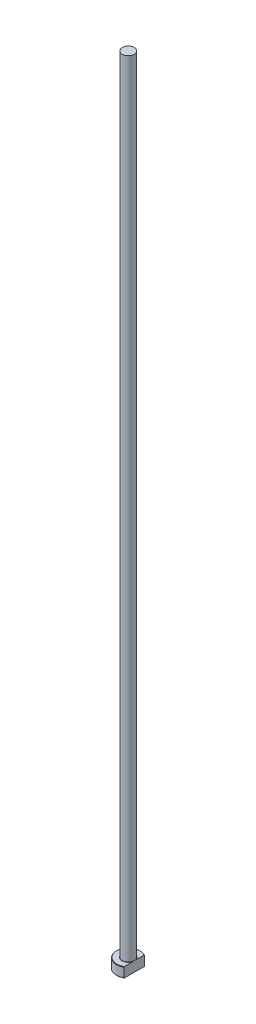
from build123d import *
from build123d.topology import SkipClean

# Parameters (mm, degrees)
CHAMFER1_SIZE = 0.2
FILLET1_R     = 0.2
KEY_DEPTH     = 401.089989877


with BuildPart() as part:
    # Sketch1 → Revolve1 (revolve)
    with BuildSketch(Plane.XY, mode=Mode.PRIVATE) as revolve1_sk:
        Polygon((0, 0), (-6, 0), (-6, 5), (-3, 5), (-3, 400), (0, 400), align=None)
    revolve(revolve1_sk.sketch.rotate(Axis((0, 259.958771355, 0), (0, -1, 0)), 270), axis=Axis((0, 259.958771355, 0), (0, -1, 0)))

    # Chamfer1
    chamfer1_edges = [part.edges().sort_by_distance(p)[0] for p in [
        (0, 5, -6),
        (0, 0, -6),
    ]]
    chamfer(chamfer1_edges, length=CHAMFER1_SIZE)

    # Fillet1
    fillet1_edges = [part.edges().sort_by_distance(p)[0] for p in [
        (0, 5, -3),
    ]]
    fillet(fillet1_edges, radius=FILLET1_R)

    # Sketch2 → KEY (cut, through all)
    with SkipClean():  # the faces are left unmerged after this step: merging them gives an invalid solid
        with BuildSketch(Plane(origin=(0, 0, 0), x_dir=(1, 0, 0), z_dir=(0, 1, 0))):
            with BuildLine():
                Line((3, 5.196152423), (3, -5.196152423))
                ThreePointArc((3, -5.196152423), (6, 0), (3, 5.196152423))
            make_face()
        extrude(amount=KEY_DEPTH, mode=Mode.SUBTRACT)


solid = part.part
